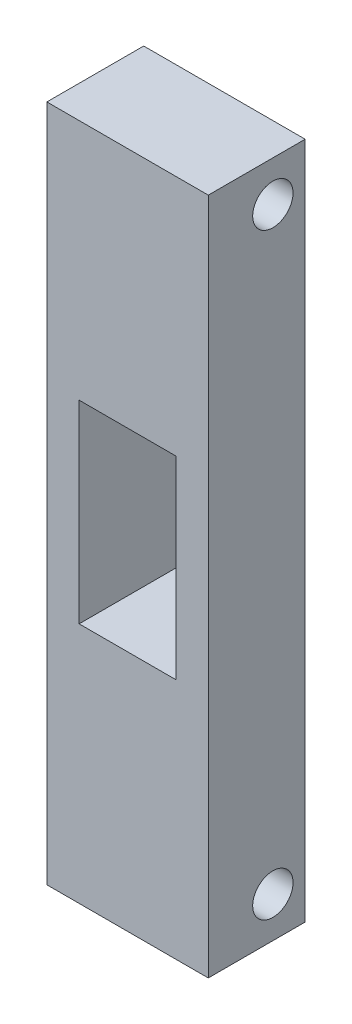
from build123d import *

# Parameters (mm, degrees)
SKETCH_1_W          = 10
SKETCH_1_H          = 42
SKETCH_1_W_2        = 6
SKETCH_1_H_2        = 12
EXTRUDE_1_DEPTH     = 6
SKETCH_2_R          = 1.25
CUT_EXTRUDE_1_DEPTH = 12


with BuildPart() as part:
    # Sketch 1 → Extrude 1 (new body)
    with BuildSketch(Plane.XY):
        Rectangle(SKETCH_1_W, SKETCH_1_H)
        Rectangle(SKETCH_1_W_2, SKETCH_1_H_2, mode=Mode.SUBTRACT)
    extrude(amount=EXTRUDE_1_DEPTH)

    # Sketch 2 → Cut-Extrude 1 (cut)
    with BuildSketch(Plane(origin=(5, 0, 0), x_dir=(0, 0, -1), z_dir=(1, 0, 0))):
        with Locations(Location((-2, 18.5, 0), (0, 0, 90))):
            Circle(SKETCH_2_R)
        with Locations(Location((-2, -18.5, 0), (0, 0, 90))):
            Circle(SKETCH_2_R)
    extrude(amount=-CUT_EXTRUDE_1_DEPTH, mode=Mode.SUBTRACT)


solid = part.part
